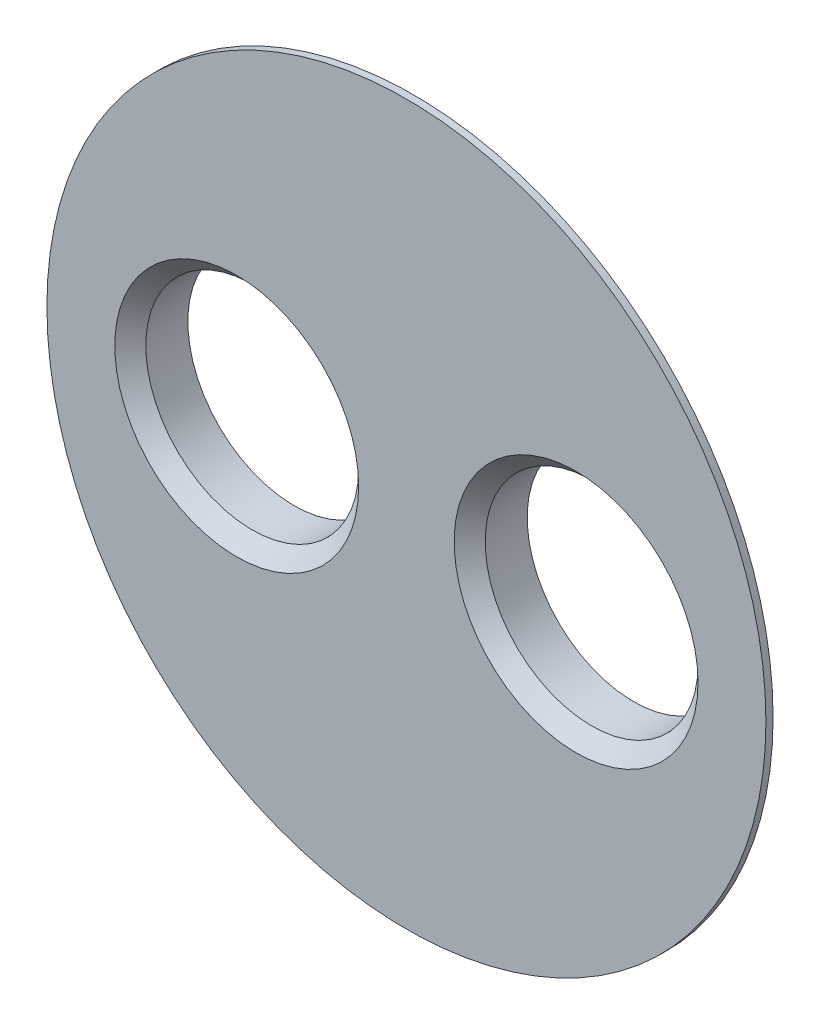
ISO-10303-21;
HEADER;
FILE_DESCRIPTION(('STEP AP214'),'2;1');
FILE_NAME('part.step','',(''),(''),'','','');
FILE_SCHEMA(('AUTOMOTIVE_DESIGN { 1 0 10303 214 1 1 1 1 }'));
ENDSEC;
DATA;
#1=APPLICATION_CONTEXT('core data for automotive mechanical design processes');
#2=APPLICATION_PROTOCOL_DEFINITION('international standard','automotive_design',2000,#1);
#3=PRODUCT_CONTEXT('',#1,'mechanical');
#4=PRODUCT('Part','Part','',(#3));
#5=PRODUCT_RELATED_PRODUCT_CATEGORY('part','',(#4));
#6=PRODUCT_DEFINITION_FORMATION('','',#4);
#7=PRODUCT_DEFINITION_CONTEXT('part definition',#1,'design');
#8=PRODUCT_DEFINITION('design','',#6,#7);
#9=PRODUCT_DEFINITION_SHAPE('','',#8);
#10=(LENGTH_UNIT() NAMED_UNIT(*) SI_UNIT(.MILLI.,.METRE.));
#11=(NAMED_UNIT(*) PLANE_ANGLE_UNIT() SI_UNIT($,.RADIAN.));
#12=(NAMED_UNIT(*) SI_UNIT($,.STERADIAN.) SOLID_ANGLE_UNIT());
#13=UNCERTAINTY_MEASURE_WITH_UNIT(LENGTH_MEASURE(1.E-05),#10,'distance_accuracy_value','');
#14=(GEOMETRIC_REPRESENTATION_CONTEXT(3) GLOBAL_UNCERTAINTY_ASSIGNED_CONTEXT((#13)) GLOBAL_UNIT_ASSIGNED_CONTEXT((#10,
#11,#12)) REPRESENTATION_CONTEXT('',''));
#15=CARTESIAN_POINT('',(0.,0.,0.));
#16=DIRECTION('',(0.,0.,1.));
#17=DIRECTION('',(1.,0.,0.));
#18=AXIS2_PLACEMENT_3D('',#15,#16,#17);
#19=CARTESIAN_POINT('',(0.,0.,10.));
#20=DIRECTION('',(0.,0.,-1.));
#21=DIRECTION('',(-1.,0.,0.));
#22=AXIS2_PLACEMENT_3D('',#19,#20,#21);
#23=CYLINDRICAL_SURFACE('',#22,62.5);
#24=CARTESIAN_POINT('',(0.,0.,8.75259422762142));
#25=DIRECTION('',(0.,0.,1.));
#26=DIRECTION('',(1.,0.,0.));
#27=AXIS2_PLACEMENT_3D('',#24,#25,#26);
#28=CIRCLE('',#27,62.5);
#29=CARTESIAN_POINT('',(62.5,0.,8.75259422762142));
#30=VERTEX_POINT('',#29);
#31=EDGE_CURVE('E49',#30,#30,#28,.T.);
#32=ORIENTED_EDGE('',*,*,#31,.T.);
#33=EDGE_LOOP('',(#32));
#34=FACE_BOUND('',#33,.T.);
#35=CARTESIAN_POINT('',(0.,0.,10.));
#36=DIRECTION('',(0.,0.,1.));
#37=DIRECTION('',(1.,0.,0.));
#38=AXIS2_PLACEMENT_3D('',#35,#36,#37);
#39=CIRCLE('',#38,62.5);
#40=CARTESIAN_POINT('',(62.5,0.,10.));
#41=VERTEX_POINT('',#40);
#42=EDGE_CURVE('E76',#41,#41,#39,.T.);
#43=ORIENTED_EDGE('',*,*,#42,.F.);
#44=EDGE_LOOP('',(#43));
#45=FACE_BOUND('',#44,.T.);
#46=ADVANCED_FACE('F40',(#34,#45),#23,.T.);
#47=CARTESIAN_POINT('',(0.,0.,10.));
#48=DIRECTION('',(0.,0.,1.));
#49=DIRECTION('',(1.,0.,0.));
#50=AXIS2_PLACEMENT_3D('',#47,#48,#49);
#51=PLANE('',#50);
#52=CARTESIAN_POINT('',(29.5,0.,10.));
#53=DIRECTION('',(0.,0.,1.));
#54=DIRECTION('',(1.,0.,0.));
#55=AXIS2_PLACEMENT_3D('',#52,#53,#54);
#56=CIRCLE('',#55,21.2);
#57=CARTESIAN_POINT('',(50.7,0.,10.));
#58=VERTEX_POINT('',#57);
#59=EDGE_CURVE('E62',#58,#58,#56,.F.);
#60=ORIENTED_EDGE('',*,*,#59,.T.);
#61=EDGE_LOOP('',(#60));
#62=FACE_BOUND('',#61,.T.);
#63=CARTESIAN_POINT('',(-29.5,0.,10.));
#64=DIRECTION('',(0.,0.,1.));
#65=DIRECTION('',(1.,0.,0.));
#66=AXIS2_PLACEMENT_3D('',#63,#64,#65);
#67=CIRCLE('',#66,21.2);
#68=CARTESIAN_POINT('',(-8.29999999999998,0.,10.));
#69=VERTEX_POINT('',#68);
#70=EDGE_CURVE('E68',#69,#69,#67,.F.);
#71=ORIENTED_EDGE('',*,*,#70,.T.);
#72=EDGE_LOOP('',(#71));
#73=FACE_BOUND('',#72,.T.);
#74=ORIENTED_EDGE('',*,*,#42,.T.);
#75=EDGE_LOOP('',(#74));
#76=FACE_BOUND('',#75,.T.);
#77=ADVANCED_FACE('F108',(#62,#73,#76),#51,.T.);
#78=CARTESIAN_POINT('',(0.,0.,0.));
#79=DIRECTION('',(0.,0.,1.));
#80=DIRECTION('',(1.,0.,0.));
#81=AXIS2_PLACEMENT_3D('',#78,#79,#80);
#82=PLANE('',#81);
#83=CARTESIAN_POINT('',(0.,0.,0.));
#84=DIRECTION('',(0.,0.,1.));
#85=DIRECTION('',(1.,0.,0.));
#86=AXIS2_PLACEMENT_3D('',#83,#84,#85);
#87=CIRCLE('',#86,49.9999999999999);
#88=CARTESIAN_POINT('',(49.9999999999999,0.,0.));
#89=VERTEX_POINT('',#88);
#90=EDGE_CURVE('E10',#89,#89,#87,.F.);
#91=ORIENTED_EDGE('',*,*,#90,.T.);
#92=EDGE_LOOP('',(#91));
#93=FACE_BOUND('',#92,.T.);
#94=CARTESIAN_POINT('',(-29.5,0.,0.));
#95=DIRECTION('',(0.,0.,1.));
#96=DIRECTION('',(1.,0.,0.));
#97=AXIS2_PLACEMENT_3D('',#94,#95,#96);
#98=CIRCLE('',#97,18.5);
#99=CARTESIAN_POINT('',(-11.,0.,0.));
#100=VERTEX_POINT('',#99);
#101=EDGE_CURVE('E80',#100,#100,#98,.T.);
#102=ORIENTED_EDGE('',*,*,#101,.T.);
#103=EDGE_LOOP('',(#102));
#104=FACE_BOUND('',#103,.T.);
#105=CARTESIAN_POINT('',(29.5,0.,0.));
#106=DIRECTION('',(0.,0.,1.));
#107=DIRECTION('',(1.,0.,0.));
#108=AXIS2_PLACEMENT_3D('',#105,#106,#107);
#109=CIRCLE('',#108,18.5);
#110=CARTESIAN_POINT('',(48.,0.,0.));
#111=VERTEX_POINT('',#110);
#112=EDGE_CURVE('E81',#111,#111,#109,.T.);
#113=ORIENTED_EDGE('',*,*,#112,.T.);
#114=EDGE_LOOP('',(#113));
#115=FACE_BOUND('',#114,.T.);
#116=ADVANCED_FACE('F89',(#93,#104,#115),#82,.F.);
#117=CARTESIAN_POINT('',(29.5,0.,0.));
#118=DIRECTION('',(0.,0.,1.));
#119=DIRECTION('',(1.,0.,0.));
#120=AXIS2_PLACEMENT_3D('',#117,#118,#119);
#121=CYLINDRICAL_SURFACE('',#120,18.5);
#122=CARTESIAN_POINT('',(29.5,0.,7.29999999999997));
#123=DIRECTION('',(0.,0.,1.));
#124=DIRECTION('',(1.,0.,0.));
#125=AXIS2_PLACEMENT_3D('',#122,#123,#124);
#126=CIRCLE('',#125,18.5);
#127=CARTESIAN_POINT('',(48.,0.,7.29999999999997));
#128=VERTEX_POINT('',#127);
#129=EDGE_CURVE('E72',#128,#128,#126,.T.);
#130=ORIENTED_EDGE('',*,*,#129,.T.);
#131=EDGE_LOOP('',(#130));
#132=FACE_BOUND('',#131,.T.);
#133=ORIENTED_EDGE('',*,*,#112,.F.);
#134=EDGE_LOOP('',(#133));
#135=FACE_BOUND('',#134,.T.);
#136=ADVANCED_FACE('F95',(#132,#135),#121,.F.);
#137=CARTESIAN_POINT('',(-29.5,0.,0.));
#138=DIRECTION('',(0.,0.,1.));
#139=DIRECTION('',(1.,0.,0.));
#140=AXIS2_PLACEMENT_3D('',#137,#138,#139);
#141=CYLINDRICAL_SURFACE('',#140,18.5);
#142=CARTESIAN_POINT('',(-29.5,0.,7.29999999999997));
#143=DIRECTION('',(0.,0.,1.));
#144=DIRECTION('',(1.,0.,0.));
#145=AXIS2_PLACEMENT_3D('',#142,#143,#144);
#146=CIRCLE('',#145,18.5);
#147=CARTESIAN_POINT('',(-11.,0.,7.29999999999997));
#148=VERTEX_POINT('',#147);
#149=EDGE_CURVE('E56',#148,#148,#146,.T.);
#150=ORIENTED_EDGE('',*,*,#149,.T.);
#151=EDGE_LOOP('',(#150));
#152=FACE_BOUND('',#151,.T.);
#153=ORIENTED_EDGE('',*,*,#101,.F.);
#154=EDGE_LOOP('',(#153));
#155=FACE_BOUND('',#154,.T.);
#156=ADVANCED_FACE('F92',(#152,#155),#141,.F.);
#157=CARTESIAN_POINT('',(29.5,0.,7.29999999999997));
#158=DIRECTION('',(0.,0.,1.));
#159=DIRECTION('',(1.,0.,0.));
#160=AXIS2_PLACEMENT_3D('',#157,#158,#159);
#161=CONICAL_SURFACE('',#160,18.5,0.785398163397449);
#162=ORIENTED_EDGE('',*,*,#59,.F.);
#163=EDGE_LOOP('',(#162));
#164=FACE_BOUND('',#163,.T.);
#165=ORIENTED_EDGE('',*,*,#129,.F.);
#166=EDGE_LOOP('',(#165));
#167=FACE_BOUND('',#166,.T.);
#168=ADVANCED_FACE('F94',(#164,#167),#161,.F.);
#169=CARTESIAN_POINT('',(-29.5,0.,7.29999999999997));
#170=DIRECTION('',(0.,0.,1.));
#171=DIRECTION('',(1.,0.,0.));
#172=AXIS2_PLACEMENT_3D('',#169,#170,#171);
#173=CONICAL_SURFACE('',#172,18.5,0.785398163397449);
#174=ORIENTED_EDGE('',*,*,#70,.F.);
#175=EDGE_LOOP('',(#174));
#176=FACE_BOUND('',#175,.T.);
#177=ORIENTED_EDGE('',*,*,#149,.F.);
#178=EDGE_LOOP('',(#177));
#179=FACE_BOUND('',#178,.T.);
#180=ADVANCED_FACE('F102',(#176,#179),#173,.F.);
#181=CARTESIAN_POINT('',(0.,0.,8.75259422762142));
#182=DIRECTION('',(0.,0.,1.));
#183=DIRECTION('',(1.,0.,0.));
#184=AXIS2_PLACEMENT_3D('',#181,#182,#183);
#185=CONICAL_SURFACE('',#184,62.5,0.959931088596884);
#186=ORIENTED_EDGE('',*,*,#90,.F.);
#187=EDGE_LOOP('',(#186));
#188=FACE_BOUND('',#187,.T.);
#189=ORIENTED_EDGE('',*,*,#31,.F.);
#190=EDGE_LOOP('',(#189));
#191=FACE_BOUND('',#190,.T.);
#192=ADVANCED_FACE('F43',(#188,#191),#185,.T.);
#193=CLOSED_SHELL('',(#46,#77,#116,#136,#156,#168,#180,#192));
#194=MANIFOLD_SOLID_BREP('B2',#193);
#195=ADVANCED_BREP_SHAPE_REPRESENTATION('',(#18,#194),#14);
#196=SHAPE_DEFINITION_REPRESENTATION(#9,#195);
ENDSEC;
END-ISO-10303-21;
